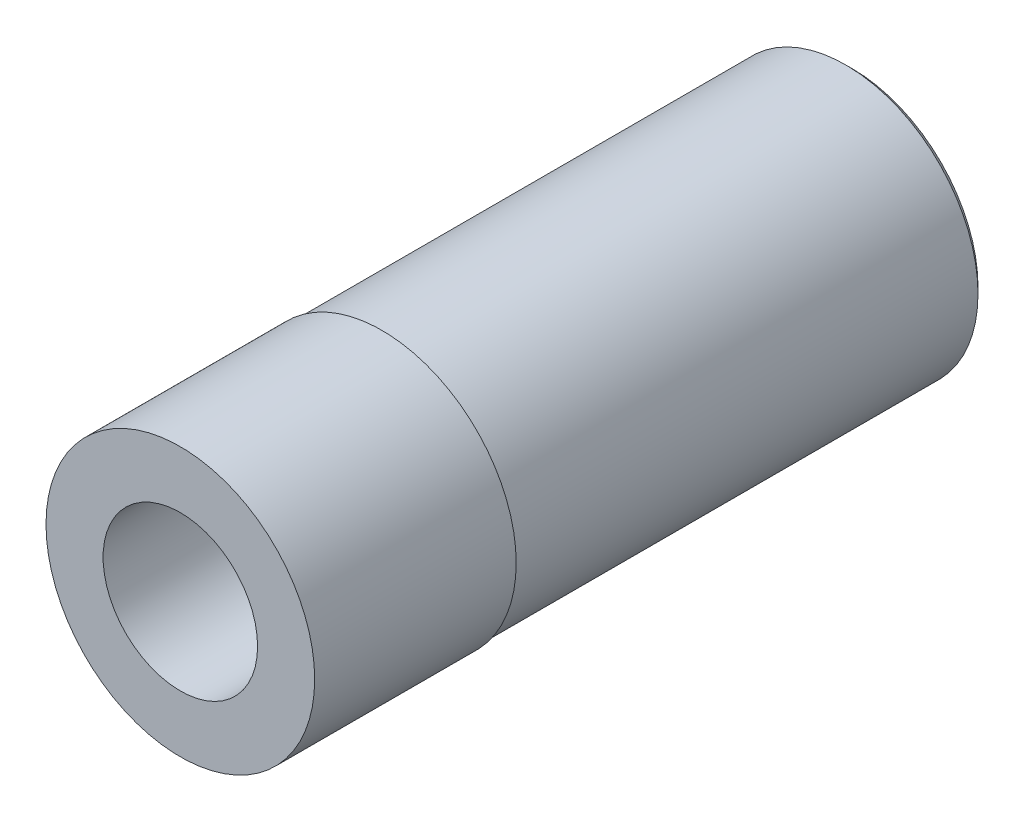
from build123d import *

# Parameters (mm, degrees)
SKETCH4_W          = 14
SKETCH4_H          = 1
CUT_EXTRUDE2_DEPTH = 2


with BuildPart() as part:
    # Sketch1 → Revolve1 (revolve)
    with BuildSketch(Plane(origin=(0, 0, 0), x_dir=(0, 0, -1), z_dir=(1, 0, 0)), mode=Mode.PRIVATE) as revolve1_sk:
        Polygon((0, 4), (0, 2.3), (4, 2.3), (4, 1.25), (16, 1.25), (16, 2), (20, 2), (20, 3.75), (19.75, 4), align=None)
    revolve(revolve1_sk.sketch.rotate(Axis((0, 0, 3.797909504), (0, 0, -1)), 90), axis=Axis((0, 0, 3.797909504), (0, 0, -1)))

    # Sketch4 → Cut-Revolve1 (revolve, cut)
    with BuildSketch(Plane(origin=(0, 0, 0), x_dir=(0, 0, -1), z_dir=(1, 0, 0)), mode=Mode.PRIVATE) as cut_revolve1_sk:
        with Locations((13, 4.435)):
            Rectangle(SKETCH4_W, SKETCH4_H)
    revolve(cut_revolve1_sk.sketch.rotate(Axis((0, 0, 0), (0, 0, -1)), 90), axis=Axis((0, 0, 0), (0, 0, -1)), mode=Mode.SUBTRACT)

    # Sketch3 → Cut-Extrude2 (cut)
    with BuildSketch(Plane.XY.offset(-4)):
        Polygon((0.721687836, 1.25), (-0.721687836, 1.25), (-1.443375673, 0), (-0.721687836, -1.25), (0.721687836, -1.25), (1.443375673, 0), align=None)
    extrude(amount=-CUT_EXTRUDE2_DEPTH, mode=Mode.SUBTRACT)


solid = part.part
